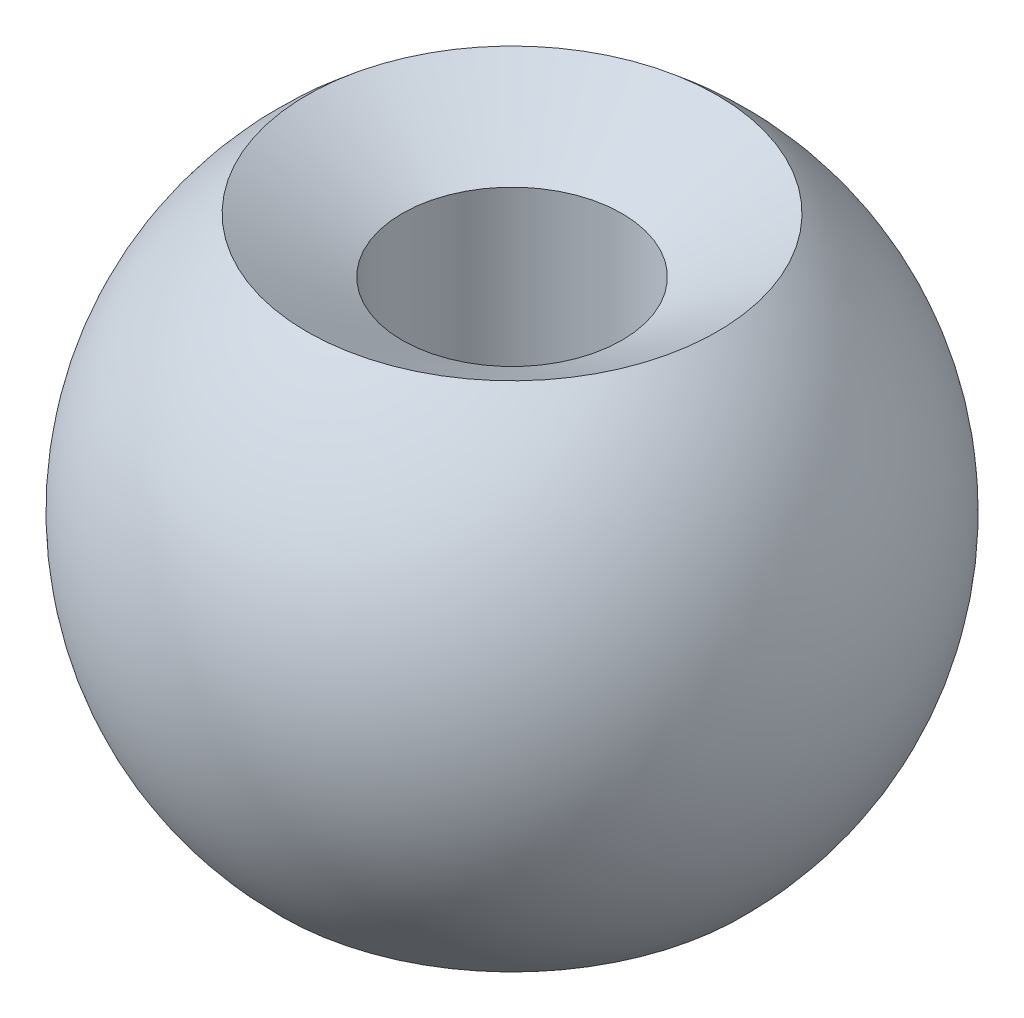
ISO-10303-21;
HEADER;
FILE_DESCRIPTION(('STEP AP214'),'2;1');
FILE_NAME('part.step','',(''),(''),'','','');
FILE_SCHEMA(('AUTOMOTIVE_DESIGN { 1 0 10303 214 1 1 1 1 }'));
ENDSEC;
DATA;
#1=APPLICATION_CONTEXT('core data for automotive mechanical design processes');
#2=APPLICATION_PROTOCOL_DEFINITION('international standard','automotive_design',2000,#1);
#3=PRODUCT_CONTEXT('',#1,'mechanical');
#4=PRODUCT('Part','Part','',(#3));
#5=PRODUCT_RELATED_PRODUCT_CATEGORY('part','',(#4));
#6=PRODUCT_DEFINITION_FORMATION('','',#4);
#7=PRODUCT_DEFINITION_CONTEXT('part definition',#1,'design');
#8=PRODUCT_DEFINITION('design','',#6,#7);
#9=PRODUCT_DEFINITION_SHAPE('','',#8);
#10=(LENGTH_UNIT() NAMED_UNIT(*) SI_UNIT(.MILLI.,.METRE.));
#11=(NAMED_UNIT(*) PLANE_ANGLE_UNIT() SI_UNIT($,.RADIAN.));
#12=(NAMED_UNIT(*) SI_UNIT($,.STERADIAN.) SOLID_ANGLE_UNIT());
#13=UNCERTAINTY_MEASURE_WITH_UNIT(LENGTH_MEASURE(1.E-05),#10,'distance_accuracy_value','');
#14=(GEOMETRIC_REPRESENTATION_CONTEXT(3) GLOBAL_UNCERTAINTY_ASSIGNED_CONTEXT((#13)) GLOBAL_UNIT_ASSIGNED_CONTEXT((#10,
#11,#12)) REPRESENTATION_CONTEXT('',''));
#15=CARTESIAN_POINT('',(0.,0.,0.));
#16=DIRECTION('',(0.,0.,1.));
#17=DIRECTION('',(1.,0.,0.));
#18=AXIS2_PLACEMENT_3D('',#15,#16,#17);
#19=CARTESIAN_POINT('',(0.,8.99999999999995,0.));
#20=DIRECTION('',(0.,0.999999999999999,0.));
#21=DIRECTION('',(0.,0.,0.999999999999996));
#22=AXIS2_PLACEMENT_3D('',#19,#20,#21);
#23=CONICAL_SURFACE('',#22,3.73205080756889,1.0471975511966);
#24=CARTESIAN_POINT('',(0.,7.99999999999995,-2.22044604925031E-13));
#25=DIRECTION('',(0.,-0.999999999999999,0.));
#26=DIRECTION('',(0.,0.,-0.999999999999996));
#27=AXIS2_PLACEMENT_3D('',#24,#25,#26);
#28=CIRCLE('',#27,2.);
#29=CARTESIAN_POINT('',(0.,7.99999999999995,1.99999999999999));
#30=VERTEX_POINT('',#29);
#31=EDGE_CURVE('E51',#30,#30,#28,.T.);
#32=CARTESIAN_POINT('',(0.,8.99999999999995,0.));
#33=DIRECTION('',(0.,-0.999999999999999,0.));
#34=DIRECTION('',(0.,0.,-0.999999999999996));
#35=AXIS2_PLACEMENT_3D('',#32,#33,#34);
#36=CIRCLE('',#35,3.73205080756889);
#37=CARTESIAN_POINT('',(0.,8.99999999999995,3.73205080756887));
#38=VERTEX_POINT('',#37);
#39=EDGE_CURVE('E10',#38,#38,#36,.T.);
#40=CARTESIAN_POINT('',(0.,7.99999999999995,1.99999999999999));
#41=CARTESIAN_POINT('',(0.,8.01041666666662,2.01804219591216));
#42=CARTESIAN_POINT('',(0.,8.02083333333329,2.03608439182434));
#43=CARTESIAN_POINT('',(0.,8.04166666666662,2.07216878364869));
#44=CARTESIAN_POINT('',(0.,8.05208333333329,2.09021097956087));
#45=CARTESIAN_POINT('',(0.,8.07291666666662,2.12629537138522));
#46=CARTESIAN_POINT('',(0.,8.08333333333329,2.14433756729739));
#47=CARTESIAN_POINT('',(0.,8.10416666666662,2.18042195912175));
#48=CARTESIAN_POINT('',(0.,8.11458333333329,2.19846415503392));
#49=CARTESIAN_POINT('',(0.,8.13541666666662,2.23454854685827));
#50=CARTESIAN_POINT('',(0.,8.14583333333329,2.25259074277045));
#51=CARTESIAN_POINT('',(0.,8.16666666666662,2.2886751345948));
#52=CARTESIAN_POINT('',(0.,8.17708333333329,2.30671733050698));
#53=CARTESIAN_POINT('',(0.,8.19791666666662,2.34280172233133));
#54=CARTESIAN_POINT('',(0.,8.20833333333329,2.3608439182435));
#55=CARTESIAN_POINT('',(0.,8.22916666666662,2.39692831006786));
#56=CARTESIAN_POINT('',(0.,8.23958333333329,2.41497050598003));
#57=CARTESIAN_POINT('',(0.,8.26041666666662,2.45105489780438));
#58=CARTESIAN_POINT('',(0.,8.27083333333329,2.46909709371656));
#59=CARTESIAN_POINT('',(0.,8.29166666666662,2.50518148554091));
#60=CARTESIAN_POINT('',(0.,8.30208333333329,2.52322368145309));
#61=CARTESIAN_POINT('',(0.,8.32291666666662,2.55930807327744));
#62=CARTESIAN_POINT('',(0.,8.33333333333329,2.57735026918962));
#63=CARTESIAN_POINT('',(0.,8.35416666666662,2.61343466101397));
#64=CARTESIAN_POINT('',(0.,8.36458333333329,2.63147685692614));
#65=CARTESIAN_POINT('',(0.,8.38541666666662,2.66756124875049));
#66=CARTESIAN_POINT('',(0.,8.39583333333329,2.68560344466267));
#67=CARTESIAN_POINT('',(0.,8.41666666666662,2.72168783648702));
#68=CARTESIAN_POINT('',(0.,8.42708333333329,2.7397300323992));
#69=CARTESIAN_POINT('',(0.,8.44791666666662,2.77581442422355));
#70=CARTESIAN_POINT('',(0.,8.45833333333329,2.79385662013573));
#71=CARTESIAN_POINT('',(0.,8.47916666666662,2.82994101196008));
#72=CARTESIAN_POINT('',(0.,8.48958333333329,2.84798320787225));
#73=CARTESIAN_POINT('',(0.,8.51041666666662,2.88406759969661));
#74=CARTESIAN_POINT('',(0.,8.52083333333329,2.90210979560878));
#75=CARTESIAN_POINT('',(0.,8.54166666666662,2.93819418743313));
#76=CARTESIAN_POINT('',(0.,8.55208333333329,2.95623638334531));
#77=CARTESIAN_POINT('',(0.,8.57291666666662,2.99232077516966));
#78=CARTESIAN_POINT('',(0.,8.58333333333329,3.01036297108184));
#79=CARTESIAN_POINT('',(0.,8.60416666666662,3.04644736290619));
#80=CARTESIAN_POINT('',(0.,8.61458333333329,3.06448955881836));
#81=CARTESIAN_POINT('',(0.,8.63541666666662,3.10057395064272));
#82=CARTESIAN_POINT('',(0.,8.64583333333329,3.11861614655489));
#83=CARTESIAN_POINT('',(0.,8.66666666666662,3.15470053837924));
#84=CARTESIAN_POINT('',(0.,8.67708333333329,3.17274273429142));
#85=CARTESIAN_POINT('',(0.,8.69791666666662,3.20882712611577));
#86=CARTESIAN_POINT('',(0.,8.70833333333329,3.22686932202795));
#87=CARTESIAN_POINT('',(0.,8.72916666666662,3.2629537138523));
#88=CARTESIAN_POINT('',(0.,8.73958333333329,3.28099590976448));
#89=CARTESIAN_POINT('',(0.,8.76041666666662,3.31708030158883));
#90=CARTESIAN_POINT('',(0.,8.77083333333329,3.335122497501));
#91=CARTESIAN_POINT('',(0.,8.79166666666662,3.37120688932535));
#92=CARTESIAN_POINT('',(0.,8.80208333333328,3.38924908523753));
#93=CARTESIAN_POINT('',(0.,8.82291666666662,3.42533347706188));
#94=CARTESIAN_POINT('',(0.,8.83333333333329,3.44337567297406));
#95=CARTESIAN_POINT('',(0.,8.85416666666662,3.47946006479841));
#96=CARTESIAN_POINT('',(0.,8.86458333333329,3.49750226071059));
#97=CARTESIAN_POINT('',(0.,8.88541666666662,3.53358665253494));
#98=CARTESIAN_POINT('',(0.,8.89583333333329,3.55162884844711));
#99=CARTESIAN_POINT('',(0.,8.91666666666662,3.58771324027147));
#100=CARTESIAN_POINT('',(0.,8.92708333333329,3.60575543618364));
#101=CARTESIAN_POINT('',(0.,8.94791666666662,3.64183982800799));
#102=CARTESIAN_POINT('',(0.,8.95833333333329,3.65988202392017));
#103=CARTESIAN_POINT('',(0.,8.97916666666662,3.69596641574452));
#104=CARTESIAN_POINT('',(0.,8.98958333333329,3.7140086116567));
#105=CARTESIAN_POINT('',(0.,8.99999999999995,3.73205080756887));
#106=B_SPLINE_CURVE_WITH_KNOTS('',3,(#40,#41,#42,#43,#44,#45,#46,#47,#48,#49,#50,#51,#52,#53,
#54,#55,#56,#57,#58,#59,#60,#61,#62,#63,#64,#65,#66,#67,#68,#69,#70,#71,#72,#73,#74,#75,#76,#77,
#78,#79,#80,#81,#82,#83,#84,#85,#86,#87,#88,#89,#90,#91,#92,#93,#94,#95,#96,#97,#98,#99,#100,
#101,#102,#103,#104,#105),.UNSPECIFIED.,.F.,.F.,(4,2,2,2,2,2,2,2,2,2,2,2,2,2,2,2,2,2,2,2,2,2,2,
2,2,2,2,2,2,2,2,2,4),(0.,0.0625000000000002,0.125,0.187500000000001,0.250000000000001,
0.312500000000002,0.375000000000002,0.437500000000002,0.500000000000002,0.562500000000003,
0.625000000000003,0.687500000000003,0.750000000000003,0.812500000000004,0.875000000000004,
0.937500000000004,1.,1.0625,1.125,1.18750000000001,1.25000000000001,1.31250000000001,
1.37500000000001,1.43750000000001,1.50000000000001,1.56250000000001,1.62500000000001,
1.68750000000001,1.75000000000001,1.81250000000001,1.87500000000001,1.93750000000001,
2.00000000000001),.UNSPECIFIED.);
#107=EDGE_CURVE('BSEAM32',#30,#38,#106,.T.);
#108=ORIENTED_EDGE('',*,*,#31,.T.);
#109=ORIENTED_EDGE('',*,*,#39,.F.);
#110=ORIENTED_EDGE('',*,*,#107,.T.);
#111=ORIENTED_EDGE('',*,*,#107,.F.);
#112=EDGE_LOOP('',(#108,#110,#109,#111));
#113=FACE_BOUND('',#112,.T.);
#114=ADVANCED_FACE('F32',(#113),#23,.F.);
#115=CARTESIAN_POINT('',(0.,4.30193691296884,-2.77555756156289E-13));
#116=DIRECTION('',(0.,-0.999999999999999,0.));
#117=DIRECTION('',(0.999999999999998,0.,0.));
#118=AXIS2_PLACEMENT_3D('',#115,#116,#117);
#119=SPHERICAL_SURFACE('',#118,6.);
#120=ORIENTED_EDGE('',*,*,#39,.T.);
#121=EDGE_LOOP('',(#120));
#122=FACE_BOUND('',#121,.T.);
#123=CARTESIAN_POINT('',(0.,0.,0.));
#124=DIRECTION('',(0.,-0.999999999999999,0.));
#125=DIRECTION('',(0.,0.,-0.999999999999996));
#126=AXIS2_PLACEMENT_3D('',#123,#124,#125);
#127=CIRCLE('',#126,4.18250389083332);
#128=CARTESIAN_POINT('',(0.,0.,-4.1825038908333));
#129=VERTEX_POINT('',#128);
#130=EDGE_CURVE('E39',#129,#129,#127,.T.);
#131=ORIENTED_EDGE('',*,*,#130,.F.);
#132=EDGE_LOOP('',(#131));
#133=FACE_BOUND('',#132,.T.);
#134=ADVANCED_FACE('F69',(#122,#133),#119,.T.);
#135=CARTESIAN_POINT('',(4.18250389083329,0.,-2.22044604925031E-13));
#136=DIRECTION('',(0.,-0.999999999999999,0.));
#137=DIRECTION('',(0.,0.,-0.999999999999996));
#138=AXIS2_PLACEMENT_3D('',#135,#136,#137);
#139=PLANE('',#138);
#140=ORIENTED_EDGE('',*,*,#130,.T.);
#141=EDGE_LOOP('',(#140));
#142=FACE_BOUND('',#141,.T.);
#143=CARTESIAN_POINT('',(0.,0.,0.));
#144=DIRECTION('',(0.,-0.999999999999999,0.));
#145=DIRECTION('',(0.,0.,-0.999999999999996));
#146=AXIS2_PLACEMENT_3D('',#143,#144,#145);
#147=CIRCLE('',#146,2.);
#148=CARTESIAN_POINT('',(0.,0.,-1.99999999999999));
#149=VERTEX_POINT('',#148);
#150=EDGE_CURVE('E45',#149,#149,#147,.T.);
#151=ORIENTED_EDGE('',*,*,#150,.F.);
#152=EDGE_LOOP('',(#151));
#153=FACE_BOUND('',#152,.T.);
#154=ADVANCED_FACE('F63',(#142,#153),#139,.T.);
#155=CARTESIAN_POINT('',(0.,0.,0.));
#156=DIRECTION('',(0.,-0.999999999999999,0.));
#157=DIRECTION('',(0.,0.,-0.999999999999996));
#158=AXIS2_PLACEMENT_3D('',#155,#156,#157);
#159=CYLINDRICAL_SURFACE('',#158,2.);
#160=ORIENTED_EDGE('',*,*,#150,.T.);
#161=EDGE_LOOP('',(#160));
#162=FACE_BOUND('',#161,.T.);
#163=ORIENTED_EDGE('',*,*,#31,.F.);
#164=EDGE_LOOP('',(#163));
#165=FACE_BOUND('',#164,.T.);
#166=ADVANCED_FACE('F61',(#162,#165),#159,.F.);
#167=CLOSED_SHELL('',(#114,#134,#154,#166));
#168=MANIFOLD_SOLID_BREP('B2',#167);
#169=ADVANCED_BREP_SHAPE_REPRESENTATION('',(#18,#168),#14);
#170=SHAPE_DEFINITION_REPRESENTATION(#9,#169);
ENDSEC;
END-ISO-10303-21;
